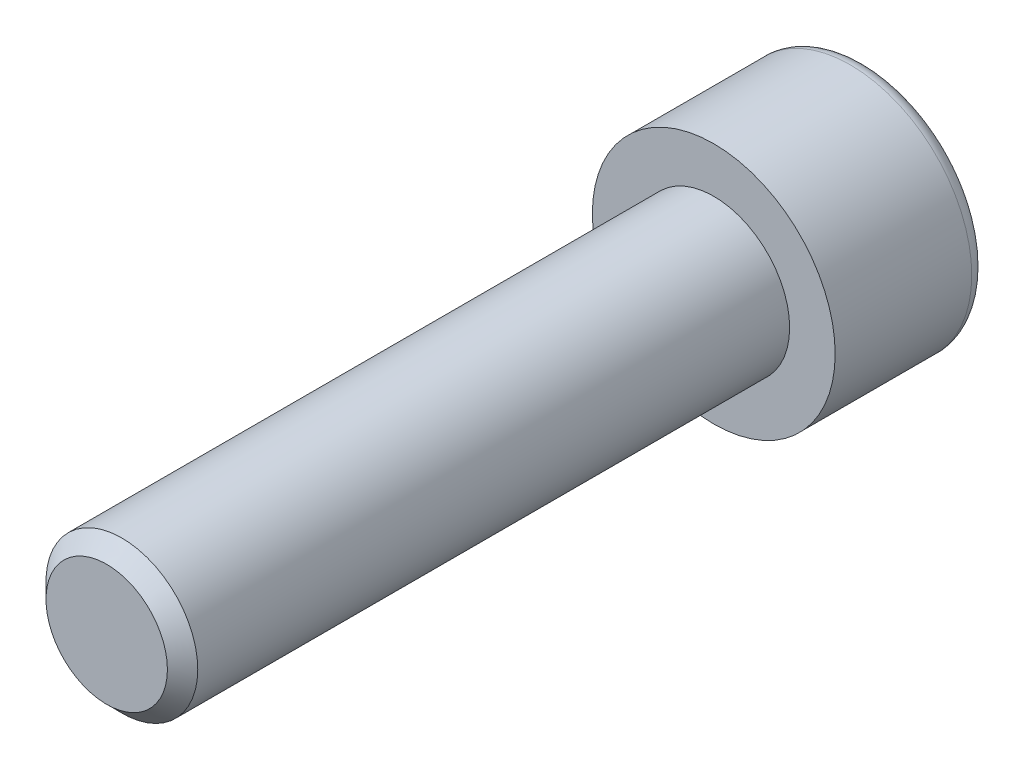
ISO-10303-21;
HEADER;
FILE_DESCRIPTION(('STEP AP214'),'2;1');
FILE_NAME('part.step','',(''),(''),'','','');
FILE_SCHEMA(('AUTOMOTIVE_DESIGN { 1 0 10303 214 1 1 1 1 }'));
ENDSEC;
DATA;
#1=APPLICATION_CONTEXT('core data for automotive mechanical design processes');
#2=APPLICATION_PROTOCOL_DEFINITION('international standard','automotive_design',2000,#1);
#3=PRODUCT_CONTEXT('',#1,'mechanical');
#4=PRODUCT('Part','Part','',(#3));
#5=PRODUCT_RELATED_PRODUCT_CATEGORY('part','',(#4));
#6=PRODUCT_DEFINITION_FORMATION('','',#4);
#7=PRODUCT_DEFINITION_CONTEXT('part definition',#1,'design');
#8=PRODUCT_DEFINITION('design','',#6,#7);
#9=PRODUCT_DEFINITION_SHAPE('','',#8);
#10=(LENGTH_UNIT() NAMED_UNIT(*) SI_UNIT(.MILLI.,.METRE.));
#11=(NAMED_UNIT(*) PLANE_ANGLE_UNIT() SI_UNIT($,.RADIAN.));
#12=(NAMED_UNIT(*) SI_UNIT($,.STERADIAN.) SOLID_ANGLE_UNIT());
#13=UNCERTAINTY_MEASURE_WITH_UNIT(LENGTH_MEASURE(1.E-05),#10,'distance_accuracy_value','');
#14=(GEOMETRIC_REPRESENTATION_CONTEXT(3) GLOBAL_UNCERTAINTY_ASSIGNED_CONTEXT((#13)) GLOBAL_UNIT_ASSIGNED_CONTEXT((#10,
#11,#12)) REPRESENTATION_CONTEXT('',''));
#15=CARTESIAN_POINT('',(0.,0.,0.));
#16=DIRECTION('',(0.,0.,1.));
#17=DIRECTION('',(1.,0.,0.));
#18=AXIS2_PLACEMENT_3D('',#15,#16,#17);
#19=CARTESIAN_POINT('',(-1.38777878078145E-13,0.,-9.99999999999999));
#20=DIRECTION('',(0.,0.,0.999999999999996));
#21=DIRECTION('',(1.,0.,0.));
#22=AXIS2_PLACEMENT_3D('',#19,#20,#21);
#23=PLANE('',#22);
#24=CARTESIAN_POINT('',(-1.38777878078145E-13,0.,-9.99999999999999));
#25=DIRECTION('',(0.,0.,-0.999999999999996));
#26=DIRECTION('',(-1.,0.,0.));
#27=AXIS2_PLACEMENT_3D('',#24,#25,#26);
#28=CIRCLE('',#27,7.);
#29=CARTESIAN_POINT('',(-7.00000000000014,0.,-10.));
#30=VERTEX_POINT('',#29);
#31=EDGE_CURVE('E144',#30,#30,#28,.T.);
#32=ORIENTED_EDGE('',*,*,#31,.T.);
#33=EDGE_LOOP('',(#32));
#34=FACE_BOUND('',#33,.T.);
#35=DIRECTION('',(-0.866025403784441,0.500000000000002,0.));
#36=VECTOR('',#35,1.);
#37=CARTESIAN_POINT('',(1.11022302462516E-13,4.61880215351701,-9.99999999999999));
#38=LINE('',#37,#36);
#39=CARTESIAN_POINT('',(4.,2.30940107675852,-9.99999999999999));
#40=VERTEX_POINT('',#39);
#41=CARTESIAN_POINT('',(1.11022302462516E-13,4.61880215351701,-9.99999999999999));
#42=VERTEX_POINT('',#41);
#43=EDGE_CURVE('E46',#40,#42,#38,.T.);
#44=ORIENTED_EDGE('',*,*,#43,.T.);
#45=DIRECTION('',(-0.866025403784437,-0.500000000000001,0.));
#46=VECTOR('',#45,1.);
#47=CARTESIAN_POINT('',(1.11022302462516E-13,4.61880215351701,-9.99999999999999));
#48=LINE('',#47,#46);
#49=CARTESIAN_POINT('',(-4.,2.30940107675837,-9.99999999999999));
#50=VERTEX_POINT('',#49);
#51=EDGE_CURVE('E117',#42,#50,#48,.T.);
#52=ORIENTED_EDGE('',*,*,#51,.T.);
#53=DIRECTION('',(0.,-1.,0.));
#54=VECTOR('',#53,1.);
#55=CARTESIAN_POINT('',(-4.00000000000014,-2.30940107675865,-9.99999999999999));
#56=LINE('',#55,#54);
#57=CARTESIAN_POINT('',(-4.00000000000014,-2.30940107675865,-9.99999999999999));
#58=VERTEX_POINT('',#57);
#59=EDGE_CURVE('E121',#50,#58,#56,.T.);
#60=ORIENTED_EDGE('',*,*,#59,.T.);
#61=DIRECTION('',(0.866025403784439,-0.500000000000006,0.));
#62=VECTOR('',#61,1.);
#63=CARTESIAN_POINT('',(-1.52655665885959E-13,-4.61880215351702,-9.99999999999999));
#64=LINE('',#63,#62);
#65=CARTESIAN_POINT('',(-1.52655665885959E-13,-4.61880215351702,-9.99999999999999));
#66=VERTEX_POINT('',#65);
#67=EDGE_CURVE('E124',#58,#66,#64,.T.);
#68=ORIENTED_EDGE('',*,*,#67,.T.);
#69=DIRECTION('',(0.866025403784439,0.499999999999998,0.));
#70=VECTOR('',#69,1.);
#71=CARTESIAN_POINT('',(-1.52655665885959E-13,-4.61880215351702,-9.99999999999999));
#72=LINE('',#71,#70);
#73=CARTESIAN_POINT('',(3.99999999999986,-2.3094010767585,-9.99999999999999));
#74=VERTEX_POINT('',#73);
#75=EDGE_CURVE('E107',#66,#74,#72,.T.);
#76=ORIENTED_EDGE('',*,*,#75,.T.);
#77=DIRECTION('',(0.,1.,0.));
#78=VECTOR('',#77,1.);
#79=CARTESIAN_POINT('',(3.99999999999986,-2.3094010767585,-9.99999999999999));
#80=LINE('',#79,#78);
#81=EDGE_CURVE('E127',#74,#40,#80,.T.);
#82=ORIENTED_EDGE('',*,*,#81,.T.);
#83=EDGE_LOOP('',(#44,#52,#60,#68,#76,#82));
#84=FACE_BOUND('',#83,.T.);
#85=ADVANCED_FACE('F31',(#34,#84),#23,.F.);
#86=CARTESIAN_POINT('',(-1.38777878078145E-13,0.,-8.99999999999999));
#87=DIRECTION('',(0.,0.,-0.999999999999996));
#88=DIRECTION('',(-1.,0.,0.));
#89=AXIS2_PLACEMENT_3D('',#86,#87,#88);
#90=TOROIDAL_SURFACE('',#89,7.,0.999999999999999);
#91=ORIENTED_EDGE('',*,*,#31,.F.);
#92=EDGE_LOOP('',(#91));
#93=FACE_BOUND('',#92,.T.);
#94=CARTESIAN_POINT('',(-1.38777878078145E-13,0.,-8.99999999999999));
#95=DIRECTION('',(0.,0.,-0.999999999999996));
#96=DIRECTION('',(-1.,0.,0.));
#97=AXIS2_PLACEMENT_3D('',#94,#95,#96);
#98=CIRCLE('',#97,8.);
#99=CARTESIAN_POINT('',(-8.,0.,-8.99999999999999));
#100=VERTEX_POINT('',#99);
#101=EDGE_CURVE('E141',#100,#100,#98,.T.);
#102=ORIENTED_EDGE('',*,*,#101,.T.);
#103=EDGE_LOOP('',(#102));
#104=FACE_BOUND('',#103,.T.);
#105=ADVANCED_FACE('F161',(#93,#104),#90,.T.);
#106=CARTESIAN_POINT('',(0.,0.,0.));
#107=DIRECTION('',(0.,0.,-0.999999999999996));
#108=DIRECTION('',(-1.,0.,0.));
#109=AXIS2_PLACEMENT_3D('',#106,#107,#108);
#110=CYLINDRICAL_SURFACE('',#109,8.);
#111=CARTESIAN_POINT('',(0.,0.,0.));
#112=DIRECTION('',(0.,0.,-0.999999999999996));
#113=DIRECTION('',(-1.,0.,0.));
#114=AXIS2_PLACEMENT_3D('',#111,#112,#113);
#115=CIRCLE('',#114,8.);
#116=CARTESIAN_POINT('',(-8.,0.,0.));
#117=VERTEX_POINT('',#116);
#118=EDGE_CURVE('E138',#117,#117,#115,.T.);
#119=CARTESIAN_POINT('',(-8.,0.,-8.99999999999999));
#120=CARTESIAN_POINT('',(-8.,0.,-8.90624999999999));
#121=CARTESIAN_POINT('',(-8.,0.,-8.8125));
#122=CARTESIAN_POINT('',(-8.,0.,-8.62499999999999));
#123=CARTESIAN_POINT('',(-8.,0.,-8.53124999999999));
#124=CARTESIAN_POINT('',(-8.,0.,-8.34374999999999));
#125=CARTESIAN_POINT('',(-8.,0.,-8.24999999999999));
#126=CARTESIAN_POINT('',(-8.,0.,-8.06249999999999));
#127=CARTESIAN_POINT('',(-8.,0.,-7.96874999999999));
#128=CARTESIAN_POINT('',(-8.,0.,-7.78124999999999));
#129=CARTESIAN_POINT('',(-8.,0.,-7.68749999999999));
#130=CARTESIAN_POINT('',(-8.,0.,-7.49999999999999));
#131=CARTESIAN_POINT('',(-8.,0.,-7.40624999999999));
#132=CARTESIAN_POINT('',(-8.,0.,-7.21874999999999));
#133=CARTESIAN_POINT('',(-8.,0.,-7.12499999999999));
#134=CARTESIAN_POINT('',(-8.,0.,-6.93749999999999));
#135=CARTESIAN_POINT('',(-8.,0.,-6.84374999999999));
#136=CARTESIAN_POINT('',(-8.,0.,-6.65624999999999));
#137=CARTESIAN_POINT('',(-8.,0.,-6.56249999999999));
#138=CARTESIAN_POINT('',(-8.,0.,-6.375));
#139=CARTESIAN_POINT('',(-8.,0.,-6.28124999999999));
#140=CARTESIAN_POINT('',(-8.,0.,-6.09374999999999));
#141=CARTESIAN_POINT('',(-8.,0.,-5.99999999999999));
#142=CARTESIAN_POINT('',(-8.,0.,-5.8125));
#143=CARTESIAN_POINT('',(-8.,0.,-5.71875));
#144=CARTESIAN_POINT('',(-8.,0.,-5.53125));
#145=CARTESIAN_POINT('',(-8.,0.,-5.4375));
#146=CARTESIAN_POINT('',(-8.,0.,-5.25));
#147=CARTESIAN_POINT('',(-8.,0.,-5.15625));
#148=CARTESIAN_POINT('',(-8.,0.,-4.96875));
#149=CARTESIAN_POINT('',(-8.,0.,-4.875));
#150=CARTESIAN_POINT('',(-8.,0.,-4.6875));
#151=CARTESIAN_POINT('',(-8.,0.,-4.59375));
#152=CARTESIAN_POINT('',(-8.,0.,-4.40625));
#153=CARTESIAN_POINT('',(-8.,0.,-4.3125));
#154=CARTESIAN_POINT('',(-8.,0.,-4.125));
#155=CARTESIAN_POINT('',(-8.,0.,-4.03125));
#156=CARTESIAN_POINT('',(-8.,0.,-3.84375));
#157=CARTESIAN_POINT('',(-8.,0.,-3.75));
#158=CARTESIAN_POINT('',(-8.,0.,-3.5625));
#159=CARTESIAN_POINT('',(-8.,0.,-3.46875));
#160=CARTESIAN_POINT('',(-8.,0.,-3.28125));
#161=CARTESIAN_POINT('',(-8.,0.,-3.1875));
#162=CARTESIAN_POINT('',(-8.,0.,-3.));
#163=CARTESIAN_POINT('',(-8.,0.,-2.90625));
#164=CARTESIAN_POINT('',(-8.,0.,-2.71875));
#165=CARTESIAN_POINT('',(-8.,0.,-2.625));
#166=CARTESIAN_POINT('',(-8.,0.,-2.4375));
#167=CARTESIAN_POINT('',(-8.,0.,-2.34375));
#168=CARTESIAN_POINT('',(-8.,0.,-2.15625));
#169=CARTESIAN_POINT('',(-8.,0.,-2.0625));
#170=CARTESIAN_POINT('',(-8.,0.,-1.875));
#171=CARTESIAN_POINT('',(-8.,0.,-1.78125));
#172=CARTESIAN_POINT('',(-8.,0.,-1.59375));
#173=CARTESIAN_POINT('',(-8.,0.,-1.5));
#174=CARTESIAN_POINT('',(-8.,0.,-1.3125));
#175=CARTESIAN_POINT('',(-8.,0.,-1.21875));
#176=CARTESIAN_POINT('',(-8.,0.,-1.03125));
#177=CARTESIAN_POINT('',(-8.,0.,-0.937499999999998));
#178=CARTESIAN_POINT('',(-8.,0.,-0.749999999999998));
#179=CARTESIAN_POINT('',(-8.,0.,-0.656249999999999));
#180=CARTESIAN_POINT('',(-8.,0.,-0.468749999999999));
#181=CARTESIAN_POINT('',(-8.,0.,-0.374999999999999));
#182=CARTESIAN_POINT('',(-8.,0.,-0.187499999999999));
#183=CARTESIAN_POINT('',(-8.,0.,-0.0937499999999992));
#184=CARTESIAN_POINT('',(-8.,0.,0.));
#185=B_SPLINE_CURVE_WITH_KNOTS('',3,(#119,#120,#121,#122,#123,#124,#125,#126,#127,#128,#129,
#130,#131,#132,#133,#134,#135,#136,#137,#138,#139,#140,#141,#142,#143,#144,#145,#146,#147,#148,
#149,#150,#151,#152,#153,#154,#155,#156,#157,#158,#159,#160,#161,#162,#163,#164,#165,#166,#167,
#168,#169,#170,#171,#172,#173,#174,#175,#176,#177,#178,#179,#180,#181,#182,#183,#184),
.UNSPECIFIED.,.F.,.F.,(4,2,2,2,2,2,2,2,2,2,2,2,2,2,2,2,2,2,2,2,2,2,2,2,2,2,2,2,2,2,2,2,4),(0.,
0.281249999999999,0.5625,0.843749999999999,1.125,1.40625,1.6875,1.96875,2.25,2.53125,2.8125,
3.09375,3.375,3.65625,3.9375,4.21875,4.5,4.78125,5.0625,5.34375,5.625,5.90625,6.1875,6.46875,
6.75,7.03125,7.3125,7.59375,7.875,8.15625,8.43749999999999,8.71875,8.99999999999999),.UNSPECIFIED.);
#186=EDGE_CURVE('BSEAM166',#100,#117,#185,.T.);
#187=ORIENTED_EDGE('',*,*,#101,.F.);
#188=ORIENTED_EDGE('',*,*,#118,.T.);
#189=ORIENTED_EDGE('',*,*,#186,.T.);
#190=ORIENTED_EDGE('',*,*,#186,.F.);
#191=EDGE_LOOP('',(#187,#189,#188,#190));
#192=FACE_BOUND('',#191,.T.);
#193=ADVANCED_FACE('F166',(#192),#110,.T.);
#194=CARTESIAN_POINT('',(0.,0.,0.));
#195=DIRECTION('',(0.,0.,-0.999999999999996));
#196=DIRECTION('',(-1.,0.,0.));
#197=AXIS2_PLACEMENT_3D('',#194,#195,#196);
#198=PLANE('',#197);
#199=CARTESIAN_POINT('',(0.,0.,0.));
#200=DIRECTION('',(0.,0.,0.999999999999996));
#201=DIRECTION('',(1.,0.,0.));
#202=AXIS2_PLACEMENT_3D('',#199,#200,#201);
#203=CIRCLE('',#202,5.);
#204=CARTESIAN_POINT('',(5.,0.,0.));
#205=VERTEX_POINT('',#204);
#206=EDGE_CURVE('E118',#205,#205,#203,.T.);
#207=ORIENTED_EDGE('',*,*,#206,.F.);
#208=EDGE_LOOP('',(#207));
#209=FACE_BOUND('',#208,.T.);
#210=ORIENTED_EDGE('',*,*,#118,.F.);
#211=EDGE_LOOP('',(#210));
#212=FACE_BOUND('',#211,.T.);
#213=ADVANCED_FACE('F173',(#209,#212),#198,.F.);
#214=CARTESIAN_POINT('',(1.11022302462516E-13,4.61880215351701,-5.));
#215=DIRECTION('',(-0.499999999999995,-0.866025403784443,0.));
#216=DIRECTION('',(0.866025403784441,-0.500000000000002,0.));
#217=AXIS2_PLACEMENT_3D('',#214,#215,#216);
#218=PLANE('',#217);
#219=ORIENTED_EDGE('',*,*,#43,.F.);
#220=DIRECTION('',(0.,0.,-0.999999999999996));
#221=VECTOR('',#220,1.);
#222=CARTESIAN_POINT('',(4.,2.30940107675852,-5.));
#223=LINE('',#222,#221);
#224=CARTESIAN_POINT('',(4.,2.30940107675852,-5.));
#225=VERTEX_POINT('',#224);
#226=EDGE_CURVE('E112',#225,#40,#223,.T.);
#227=ORIENTED_EDGE('',*,*,#226,.F.);
#228=DIRECTION('',(-0.866025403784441,0.500000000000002,0.));
#229=VECTOR('',#228,1.);
#230=CARTESIAN_POINT('',(1.11022302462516E-13,4.61880215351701,-5.));
#231=LINE('',#230,#229);
#232=CARTESIAN_POINT('',(1.11022302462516E-13,4.61880215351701,-5.));
#233=VERTEX_POINT('',#232);
#234=EDGE_CURVE('E130',#225,#233,#231,.T.);
#235=ORIENTED_EDGE('',*,*,#234,.T.);
#236=DIRECTION('',(0.,0.,-0.999999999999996));
#237=VECTOR('',#236,1.);
#238=CARTESIAN_POINT('',(1.11022302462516E-13,4.61880215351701,-5.));
#239=LINE('',#238,#237);
#240=EDGE_CURVE('E136',#233,#42,#239,.T.);
#241=ORIENTED_EDGE('',*,*,#240,.T.);
#242=EDGE_LOOP('',(#219,#227,#235,#241));
#243=FACE_BOUND('',#242,.T.);
#244=ADVANCED_FACE('F177',(#243),#218,.T.);
#245=CARTESIAN_POINT('',(1.11022302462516E-13,4.61880215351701,-5.));
#246=DIRECTION('',(0.500000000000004,-0.866025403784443,0.));
#247=DIRECTION('',(0.866025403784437,0.500000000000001,0.));
#248=AXIS2_PLACEMENT_3D('',#245,#246,#247);
#249=PLANE('',#248);
#250=ORIENTED_EDGE('',*,*,#51,.F.);
#251=ORIENTED_EDGE('',*,*,#240,.F.);
#252=DIRECTION('',(-0.866025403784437,-0.500000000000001,0.));
#253=VECTOR('',#252,1.);
#254=CARTESIAN_POINT('',(1.11022302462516E-13,4.61880215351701,-5.));
#255=LINE('',#254,#253);
#256=CARTESIAN_POINT('',(-4.,2.30940107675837,-5.));
#257=VERTEX_POINT('',#256);
#258=EDGE_CURVE('E85',#233,#257,#255,.T.);
#259=ORIENTED_EDGE('',*,*,#258,.T.);
#260=DIRECTION('',(0.,0.,-0.999999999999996));
#261=VECTOR('',#260,1.);
#262=CARTESIAN_POINT('',(-4.,2.30940107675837,-5.));
#263=LINE('',#262,#261);
#264=EDGE_CURVE('E134',#257,#50,#263,.T.);
#265=ORIENTED_EDGE('',*,*,#264,.T.);
#266=EDGE_LOOP('',(#250,#251,#259,#265));
#267=FACE_BOUND('',#266,.T.);
#268=ADVANCED_FACE('F181',(#267),#249,.T.);
#269=CARTESIAN_POINT('',(-4.00000000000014,-2.30940107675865,-5.));
#270=DIRECTION('',(1.,0.,0.));
#271=DIRECTION('',(0.,0.,-0.999999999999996));
#272=AXIS2_PLACEMENT_3D('',#269,#270,#271);
#273=PLANE('',#272);
#274=ORIENTED_EDGE('',*,*,#59,.F.);
#275=ORIENTED_EDGE('',*,*,#264,.F.);
#276=DIRECTION('',(0.,-1.,0.));
#277=VECTOR('',#276,1.);
#278=CARTESIAN_POINT('',(-4.00000000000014,-2.30940107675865,-5.));
#279=LINE('',#278,#277);
#280=CARTESIAN_POINT('',(-4.00000000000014,-2.30940107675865,-5.));
#281=VERTEX_POINT('',#280);
#282=EDGE_CURVE('E103',#257,#281,#279,.T.);
#283=ORIENTED_EDGE('',*,*,#282,.T.);
#284=DIRECTION('',(0.,0.,-0.999999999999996));
#285=VECTOR('',#284,1.);
#286=CARTESIAN_POINT('',(-4.00000000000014,-2.30940107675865,-5.));
#287=LINE('',#286,#285);
#288=EDGE_CURVE('E100',#281,#58,#287,.T.);
#289=ORIENTED_EDGE('',*,*,#288,.T.);
#290=EDGE_LOOP('',(#274,#275,#283,#289));
#291=FACE_BOUND('',#290,.T.);
#292=ADVANCED_FACE('F184',(#291),#273,.T.);
#293=CARTESIAN_POINT('',(-1.52655665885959E-13,-4.61880215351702,-5.));
#294=DIRECTION('',(0.499999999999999,0.866025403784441,0.));
#295=DIRECTION('',(-0.866025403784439,0.500000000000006,0.));
#296=AXIS2_PLACEMENT_3D('',#293,#294,#295);
#297=PLANE('',#296);
#298=ORIENTED_EDGE('',*,*,#67,.F.);
#299=ORIENTED_EDGE('',*,*,#288,.F.);
#300=DIRECTION('',(0.866025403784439,-0.500000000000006,0.));
#301=VECTOR('',#300,1.);
#302=CARTESIAN_POINT('',(-1.52655665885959E-13,-4.61880215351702,-5.));
#303=LINE('',#302,#301);
#304=CARTESIAN_POINT('',(-1.52655665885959E-13,-4.61880215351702,-5.));
#305=VERTEX_POINT('',#304);
#306=EDGE_CURVE('E95',#281,#305,#303,.T.);
#307=ORIENTED_EDGE('',*,*,#306,.T.);
#308=DIRECTION('',(0.,0.,-0.999999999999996));
#309=VECTOR('',#308,1.);
#310=CARTESIAN_POINT('',(-1.52655665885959E-13,-4.61880215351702,-5.));
#311=LINE('',#310,#309);
#312=EDGE_CURVE('E99',#305,#66,#311,.T.);
#313=ORIENTED_EDGE('',*,*,#312,.T.);
#314=EDGE_LOOP('',(#298,#299,#307,#313));
#315=FACE_BOUND('',#314,.T.);
#316=ADVANCED_FACE('F98',(#315),#297,.T.);
#317=CARTESIAN_POINT('',(-1.52655665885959E-13,-4.61880215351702,-5.));
#318=DIRECTION('',(-0.5,0.866025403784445,0.));
#319=DIRECTION('',(-0.866025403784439,-0.499999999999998,0.));
#320=AXIS2_PLACEMENT_3D('',#317,#318,#319);
#321=PLANE('',#320);
#322=ORIENTED_EDGE('',*,*,#75,.F.);
#323=ORIENTED_EDGE('',*,*,#312,.F.);
#324=DIRECTION('',(0.866025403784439,0.499999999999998,0.));
#325=VECTOR('',#324,1.);
#326=CARTESIAN_POINT('',(-1.52655665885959E-13,-4.61880215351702,-5.));
#327=LINE('',#326,#325);
#328=CARTESIAN_POINT('',(3.99999999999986,-2.3094010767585,-5.));
#329=VERTEX_POINT('',#328);
#330=EDGE_CURVE('E102',#305,#329,#327,.T.);
#331=ORIENTED_EDGE('',*,*,#330,.T.);
#332=DIRECTION('',(0.,0.,-0.999999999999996));
#333=VECTOR('',#332,1.);
#334=CARTESIAN_POINT('',(3.99999999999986,-2.3094010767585,-5.));
#335=LINE('',#334,#333);
#336=EDGE_CURVE('E76',#329,#74,#335,.T.);
#337=ORIENTED_EDGE('',*,*,#336,.T.);
#338=EDGE_LOOP('',(#322,#323,#331,#337));
#339=FACE_BOUND('',#338,.T.);
#340=ADVANCED_FACE('F105',(#339),#321,.T.);
#341=CARTESIAN_POINT('',(3.99999999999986,-2.3094010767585,-5.));
#342=DIRECTION('',(-1.,0.,0.));
#343=DIRECTION('',(0.,-1.,0.));
#344=AXIS2_PLACEMENT_3D('',#341,#342,#343);
#345=PLANE('',#344);
#346=ORIENTED_EDGE('',*,*,#81,.F.);
#347=ORIENTED_EDGE('',*,*,#336,.F.);
#348=DIRECTION('',(0.,1.,0.));
#349=VECTOR('',#348,1.);
#350=CARTESIAN_POINT('',(3.99999999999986,-2.3094010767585,-5.));
#351=LINE('',#350,#349);
#352=EDGE_CURVE('E54',#329,#225,#351,.T.);
#353=ORIENTED_EDGE('',*,*,#352,.T.);
#354=ORIENTED_EDGE('',*,*,#226,.T.);
#355=EDGE_LOOP('',(#346,#347,#353,#354));
#356=FACE_BOUND('',#355,.T.);
#357=ADVANCED_FACE('F193',(#356),#345,.T.);
#358=CARTESIAN_POINT('',(4.,2.30940107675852,-5.));
#359=DIRECTION('',(0.,0.,0.999999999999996));
#360=DIRECTION('',(1.,0.,0.));
#361=AXIS2_PLACEMENT_3D('',#358,#359,#360);
#362=PLANE('',#361);
#363=ORIENTED_EDGE('',*,*,#234,.F.);
#364=ORIENTED_EDGE('',*,*,#352,.F.);
#365=ORIENTED_EDGE('',*,*,#330,.F.);
#366=ORIENTED_EDGE('',*,*,#306,.F.);
#367=ORIENTED_EDGE('',*,*,#282,.F.);
#368=ORIENTED_EDGE('',*,*,#258,.F.);
#369=EDGE_LOOP('',(#363,#364,#365,#366,#367,#368));
#370=FACE_BOUND('',#369,.T.);
#371=ADVANCED_FACE('F110',(#370),#362,.F.);
#372=CARTESIAN_POINT('',(0.,0.,39.9999999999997));
#373=DIRECTION('',(0.,0.,0.999999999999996));
#374=DIRECTION('',(1.,0.,0.));
#375=AXIS2_PLACEMENT_3D('',#372,#373,#374);
#376=PLANE('',#375);
#377=CARTESIAN_POINT('',(0.,0.,39.9999999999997));
#378=DIRECTION('',(0.,0.,0.999999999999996));
#379=DIRECTION('',(1.,0.,0.));
#380=AXIS2_PLACEMENT_3D('',#377,#378,#379);
#381=CIRCLE('',#380,4.);
#382=CARTESIAN_POINT('',(4.,0.,39.9999999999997));
#383=VERTEX_POINT('',#382);
#384=EDGE_CURVE('E39',#383,#383,#381,.T.);
#385=ORIENTED_EDGE('',*,*,#384,.T.);
#386=EDGE_LOOP('',(#385));
#387=FACE_BOUND('',#386,.T.);
#388=ADVANCED_FACE('F149',(#387),#376,.T.);
#389=CARTESIAN_POINT('',(0.,0.,0.));
#390=DIRECTION('',(0.,0.,0.999999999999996));
#391=DIRECTION('',(1.,0.,0.));
#392=AXIS2_PLACEMENT_3D('',#389,#390,#391);
#393=CYLINDRICAL_SURFACE('',#392,5.);
#394=CARTESIAN_POINT('',(0.,0.,38.9999999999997));
#395=DIRECTION('',(0.,0.,0.999999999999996));
#396=DIRECTION('',(1.,0.,0.));
#397=AXIS2_PLACEMENT_3D('',#394,#395,#396);
#398=CIRCLE('',#397,5.);
#399=CARTESIAN_POINT('',(5.00000000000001,0.,38.9999999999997));
#400=VERTEX_POINT('',#399);
#401=EDGE_CURVE('E11',#400,#400,#398,.F.);
#402=CARTESIAN_POINT('',(5.00000000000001,0.,38.9999999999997));
#403=CARTESIAN_POINT('',(5.00000000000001,0.,38.5937499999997));
#404=CARTESIAN_POINT('',(5.00000000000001,0.,38.1874999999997));
#405=CARTESIAN_POINT('',(5.00000000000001,0.,37.3749999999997));
#406=CARTESIAN_POINT('',(5.00000000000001,0.,36.9687499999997));
#407=CARTESIAN_POINT('',(5.00000000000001,0.,36.1562499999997));
#408=CARTESIAN_POINT('',(5.00000000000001,0.,35.7499999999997));
#409=CARTESIAN_POINT('',(5.00000000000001,0.,34.9374999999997));
#410=CARTESIAN_POINT('',(5.00000000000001,0.,34.5312499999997));
#411=CARTESIAN_POINT('',(5.00000000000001,0.,33.7187499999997));
#412=CARTESIAN_POINT('',(5.00000000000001,0.,33.3124999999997));
#413=CARTESIAN_POINT('',(5.00000000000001,0.,32.4999999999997));
#414=CARTESIAN_POINT('',(5.00000000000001,0.,32.0937499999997));
#415=CARTESIAN_POINT('',(5.00000000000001,0.,31.2812499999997));
#416=CARTESIAN_POINT('',(5.00000000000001,0.,30.8749999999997));
#417=CARTESIAN_POINT('',(5.00000000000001,0.,30.0624999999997));
#418=CARTESIAN_POINT('',(5.00000000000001,0.,29.6562499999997));
#419=CARTESIAN_POINT('',(5.00000000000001,0.,28.8437499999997));
#420=CARTESIAN_POINT('',(5.00000000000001,0.,28.4374999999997));
#421=CARTESIAN_POINT('',(5.00000000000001,0.,27.6249999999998));
#422=CARTESIAN_POINT('',(5.00000000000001,0.,27.2187499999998));
#423=CARTESIAN_POINT('',(5.00000000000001,0.,26.4062499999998));
#424=CARTESIAN_POINT('',(5.00000000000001,0.,25.9999999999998));
#425=CARTESIAN_POINT('',(5.00000000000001,0.,25.1874999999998));
#426=CARTESIAN_POINT('',(5.00000000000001,0.,24.7812499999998));
#427=CARTESIAN_POINT('',(5.00000000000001,0.,23.9687499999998));
#428=CARTESIAN_POINT('',(5.00000000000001,0.,23.5624999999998));
#429=CARTESIAN_POINT('',(5.00000000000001,0.,22.7499999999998));
#430=CARTESIAN_POINT('',(5.00000000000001,0.,22.3437499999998));
#431=CARTESIAN_POINT('',(5.00000000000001,0.,21.5312499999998));
#432=CARTESIAN_POINT('',(5.00000000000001,0.,21.1249999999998));
#433=CARTESIAN_POINT('',(5.00000000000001,0.,20.3124999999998));
#434=CARTESIAN_POINT('',(5.00000000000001,0.,19.9062499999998));
#435=CARTESIAN_POINT('',(5.00000000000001,0.,19.0937499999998));
#436=CARTESIAN_POINT('',(5.00000000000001,0.,18.6874999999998));
#437=CARTESIAN_POINT('',(5.00000000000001,0.,17.8749999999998));
#438=CARTESIAN_POINT('',(5.,0.,17.4687499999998));
#439=CARTESIAN_POINT('',(5.,0.,16.6562499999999));
#440=CARTESIAN_POINT('',(5.,0.,16.2499999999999));
#441=CARTESIAN_POINT('',(5.,0.,15.4374999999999));
#442=CARTESIAN_POINT('',(5.,0.,15.0312499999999));
#443=CARTESIAN_POINT('',(5.,0.,14.2187499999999));
#444=CARTESIAN_POINT('',(5.,0.,13.8124999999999));
#445=CARTESIAN_POINT('',(5.,0.,12.9999999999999));
#446=CARTESIAN_POINT('',(5.,0.,12.5937499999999));
#447=CARTESIAN_POINT('',(5.,0.,11.7812499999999));
#448=CARTESIAN_POINT('',(5.,0.,11.3749999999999));
#449=CARTESIAN_POINT('',(5.,0.,10.5624999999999));
#450=CARTESIAN_POINT('',(5.,0.,10.1562499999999));
#451=CARTESIAN_POINT('',(5.,0.,9.34374999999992));
#452=CARTESIAN_POINT('',(5.,0.,8.93749999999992));
#453=CARTESIAN_POINT('',(5.,0.,8.12499999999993));
#454=CARTESIAN_POINT('',(5.,0.,7.71874999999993));
#455=CARTESIAN_POINT('',(5.,0.,6.90624999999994));
#456=CARTESIAN_POINT('',(5.,0.,6.49999999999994));
#457=CARTESIAN_POINT('',(5.,0.,5.68749999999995));
#458=CARTESIAN_POINT('',(5.,0.,5.28124999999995));
#459=CARTESIAN_POINT('',(5.,0.,4.46874999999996));
#460=CARTESIAN_POINT('',(5.,0.,4.06249999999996));
#461=CARTESIAN_POINT('',(5.,0.,3.24999999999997));
#462=CARTESIAN_POINT('',(5.,0.,2.84374999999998));
#463=CARTESIAN_POINT('',(5.,0.,2.03124999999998));
#464=CARTESIAN_POINT('',(5.,0.,1.62499999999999));
#465=CARTESIAN_POINT('',(5.,0.,0.812499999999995));
#466=CARTESIAN_POINT('',(5.,0.,0.406249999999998));
#467=CARTESIAN_POINT('',(5.,0.,0.));
#468=B_SPLINE_CURVE_WITH_KNOTS('',3,(#402,#403,#404,#405,#406,#407,#408,#409,#410,#411,#412,
#413,#414,#415,#416,#417,#418,#419,#420,#421,#422,#423,#424,#425,#426,#427,#428,#429,#430,#431,
#432,#433,#434,#435,#436,#437,#438,#439,#440,#441,#442,#443,#444,#445,#446,#447,#448,#449,#450,
#451,#452,#453,#454,#455,#456,#457,#458,#459,#460,#461,#462,#463,#464,#465,#466,#467),
.UNSPECIFIED.,.F.,.F.,(4,2,2,2,2,2,2,2,2,2,2,2,2,2,2,2,2,2,2,2,2,2,2,2,2,2,2,2,2,2,2,2,4),(0.,
1.21874999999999,2.43749999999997,3.65624999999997,4.87499999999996,6.09374999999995,
7.31249999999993,8.53124999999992,9.74999999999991,10.9687499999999,12.1874999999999,
13.4062499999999,14.6249999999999,15.8437499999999,17.0624999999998,18.2812499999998,
19.4999999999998,20.7187499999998,21.9374999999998,23.1562499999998,24.3749999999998,
25.5937499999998,26.8124999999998,28.0312499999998,29.2499999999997,30.4687499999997,
31.6874999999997,32.9062499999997,34.1249999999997,35.3437499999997,36.5624999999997,
37.7812499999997,38.9999999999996),.UNSPECIFIED.);
#469=EDGE_CURVE('BSEAM152',#400,#205,#468,.T.);
#470=ORIENTED_EDGE('',*,*,#401,.T.);
#471=ORIENTED_EDGE('',*,*,#206,.T.);
#472=ORIENTED_EDGE('',*,*,#469,.T.);
#473=ORIENTED_EDGE('',*,*,#469,.F.);
#474=EDGE_LOOP('',(#470,#472,#471,#473));
#475=FACE_BOUND('',#474,.T.);
#476=ADVANCED_FACE('F152',(#475),#393,.T.);
#477=CARTESIAN_POINT('',(0.,0.,39.9999999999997));
#478=DIRECTION('',(0.,0.,-0.999999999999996));
#479=DIRECTION('',(-1.,0.,0.));
#480=AXIS2_PLACEMENT_3D('',#477,#478,#479);
#481=CONICAL_SURFACE('',#480,4.,0.785398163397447);
#482=ORIENTED_EDGE('',*,*,#401,.F.);
#483=EDGE_LOOP('',(#482));
#484=FACE_BOUND('',#483,.T.);
#485=ORIENTED_EDGE('',*,*,#384,.F.);
#486=EDGE_LOOP('',(#485));
#487=FACE_BOUND('',#486,.T.);
#488=ADVANCED_FACE('F33',(#484,#487),#481,.T.);
#489=CLOSED_SHELL('',(#85,#105,#193,#213,#244,#268,#292,#316,#340,#357,#371,#388,#476,#488));
#490=MANIFOLD_SOLID_BREP('B2',#489);
#491=ADVANCED_BREP_SHAPE_REPRESENTATION('',(#18,#490),#14);
#492=SHAPE_DEFINITION_REPRESENTATION(#9,#491);
ENDSEC;
END-ISO-10303-21;
